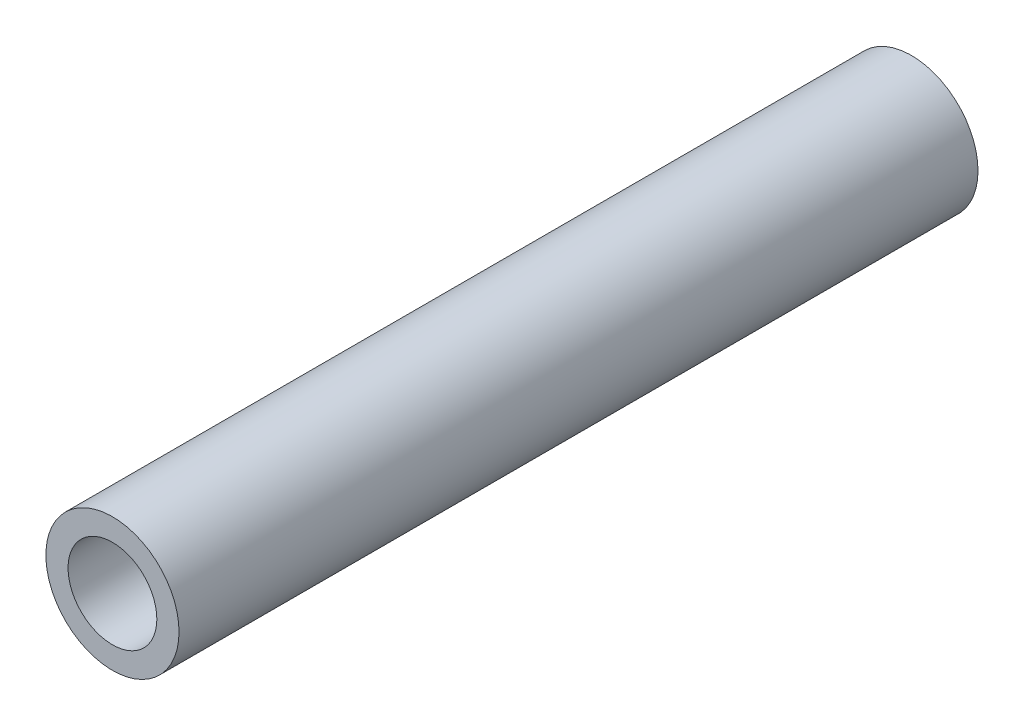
from build123d import *

# Parameters (mm, degrees)
SKETCH1_R           = 3
SKETCH1_R_2         = 2
BOSS_EXTRUDE1_DEPTH = 36


with BuildPart() as part:
    # Sketch1 → Boss-Extrude1 (new body)
    with BuildSketch(Plane.XY):
        Circle(SKETCH1_R)
        Circle(SKETCH1_R_2, mode=Mode.SUBTRACT)
    extrude(amount=BOSS_EXTRUDE1_DEPTH)


solid = part.part
